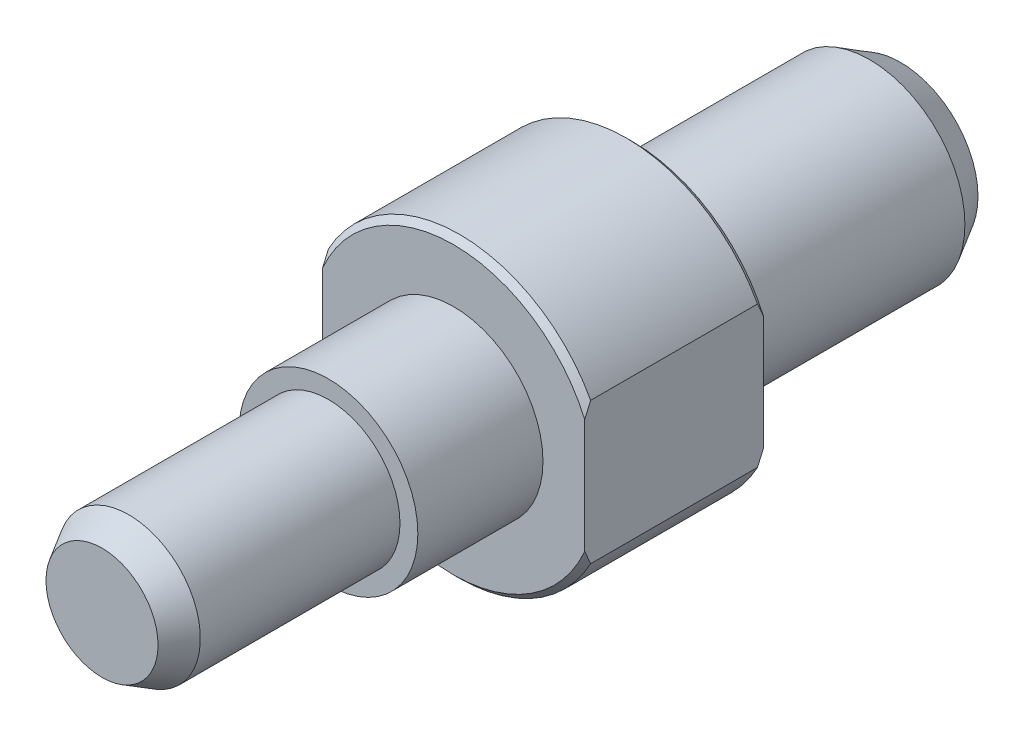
ISO-10303-21;
HEADER;
FILE_DESCRIPTION(('STEP AP214'),'2;1');
FILE_NAME('part.step','',(''),(''),'','','');
FILE_SCHEMA(('AUTOMOTIVE_DESIGN { 1 0 10303 214 1 1 1 1 }'));
ENDSEC;
DATA;
#1=APPLICATION_CONTEXT('core data for automotive mechanical design processes');
#2=APPLICATION_PROTOCOL_DEFINITION('international standard','automotive_design',2000,#1);
#3=PRODUCT_CONTEXT('',#1,'mechanical');
#4=PRODUCT('Part','Part','',(#3));
#5=PRODUCT_RELATED_PRODUCT_CATEGORY('part','',(#4));
#6=PRODUCT_DEFINITION_FORMATION('','',#4);
#7=PRODUCT_DEFINITION_CONTEXT('part definition',#1,'design');
#8=PRODUCT_DEFINITION('design','',#6,#7);
#9=PRODUCT_DEFINITION_SHAPE('','',#8);
#10=(LENGTH_UNIT() NAMED_UNIT(*) SI_UNIT(.MILLI.,.METRE.));
#11=(NAMED_UNIT(*) PLANE_ANGLE_UNIT() SI_UNIT($,.RADIAN.));
#12=(NAMED_UNIT(*) SI_UNIT($,.STERADIAN.) SOLID_ANGLE_UNIT());
#13=UNCERTAINTY_MEASURE_WITH_UNIT(LENGTH_MEASURE(1.E-05),#10,'distance_accuracy_value','');
#14=(GEOMETRIC_REPRESENTATION_CONTEXT(3) GLOBAL_UNCERTAINTY_ASSIGNED_CONTEXT((#13)) GLOBAL_UNIT_ASSIGNED_CONTEXT((#10,
#11,#12)) REPRESENTATION_CONTEXT('',''));
#15=CARTESIAN_POINT('',(0.,0.,0.));
#16=DIRECTION('',(0.,0.,1.));
#17=DIRECTION('',(1.,0.,0.));
#18=AXIS2_PLACEMENT_3D('',#15,#16,#17);
#19=CARTESIAN_POINT('',(0.,0.,44.5));
#20=DIRECTION('',(0.,0.,-1.));
#21=DIRECTION('',(-1.,0.,0.));
#22=AXIS2_PLACEMENT_3D('',#19,#20,#21);
#23=CYLINDRICAL_SURFACE('',#22,6.);
#24=CARTESIAN_POINT('',(0.,0.,25.5));
#25=DIRECTION('',(0.,0.,1.));
#26=DIRECTION('',(1.,0.,0.));
#27=AXIS2_PLACEMENT_3D('',#24,#25,#26);
#28=CIRCLE('',#27,6.);
#29=CARTESIAN_POINT('',(6.,0.,25.5));
#30=VERTEX_POINT('',#29);
#31=EDGE_CURVE('E131',#30,#30,#28,.T.);
#32=ORIENTED_EDGE('',*,*,#31,.T.);
#33=EDGE_LOOP('',(#32));
#34=FACE_BOUND('',#33,.T.);
#35=CARTESIAN_POINT('',(0.,0.,42.2483339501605));
#36=DIRECTION('',(0.,0.,-1.));
#37=DIRECTION('',(-1.,0.,0.));
#38=AXIS2_PLACEMENT_3D('',#35,#36,#37);
#39=CIRCLE('',#38,6.);
#40=CARTESIAN_POINT('',(-6.,0.,42.2483339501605));
#41=VERTEX_POINT('',#40);
#42=EDGE_CURVE('E279',#41,#41,#39,.F.);
#43=ORIENTED_EDGE('',*,*,#42,.F.);
#44=EDGE_LOOP('',(#43));
#45=FACE_BOUND('',#44,.T.);
#46=ADVANCED_FACE('F14',(#34,#45),#23,.T.);
#47=CARTESIAN_POINT('',(0.,0.,0.));
#48=DIRECTION('',(0.,0.,-1.));
#49=DIRECTION('',(-1.,0.,0.));
#50=AXIS2_PLACEMENT_3D('',#47,#48,#49);
#51=CYLINDRICAL_SURFACE('',#50,8.);
#52=CARTESIAN_POINT('',(0.,0.,0.));
#53=DIRECTION('',(0.,0.,1.));
#54=DIRECTION('',(1.,0.,0.));
#55=AXIS2_PLACEMENT_3D('',#52,#53,#54);
#56=CIRCLE('',#55,8.);
#57=CARTESIAN_POINT('',(8.,0.,0.));
#58=VERTEX_POINT('',#57);
#59=EDGE_CURVE('E137',#58,#58,#56,.T.);
#60=ORIENTED_EDGE('',*,*,#59,.F.);
#61=EDGE_LOOP('',(#60));
#62=FACE_BOUND('',#61,.T.);
#63=CARTESIAN_POINT('',(0.,0.,-19.9019237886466));
#64=DIRECTION('',(0.,0.,1.));
#65=DIRECTION('',(1.,0.,0.));
#66=AXIS2_PLACEMENT_3D('',#63,#64,#65);
#67=CIRCLE('',#66,8.);
#68=CARTESIAN_POINT('',(8.,0.,-19.9019237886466));
#69=VERTEX_POINT('',#68);
#70=EDGE_CURVE('E108',#69,#69,#67,.F.);
#71=ORIENTED_EDGE('',*,*,#70,.F.);
#72=EDGE_LOOP('',(#71));
#73=FACE_BOUND('',#72,.T.);
#74=ADVANCED_FACE('F239',(#62,#73),#51,.T.);
#75=CARTESIAN_POINT('',(0.,0.,0.));
#76=DIRECTION('',(0.,0.,1.));
#77=DIRECTION('',(1.,0.,0.));
#78=AXIS2_PLACEMENT_3D('',#75,#76,#77);
#79=PLANE('',#78);
#80=ORIENTED_EDGE('',*,*,#59,.T.);
#81=EDGE_LOOP('',(#80));
#82=FACE_BOUND('',#81,.T.);
#83=DIRECTION('',(0.,-1.,0.));
#84=VECTOR('',#83,1.);
#85=CARTESIAN_POINT('',(11.,0.,0.));
#86=LINE('',#85,#84);
#87=CARTESIAN_POINT('',(11.,4.79583152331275,0.));
#88=VERTEX_POINT('',#87);
#89=CARTESIAN_POINT('',(11.,-4.79583152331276,0.));
#90=VERTEX_POINT('',#89);
#91=EDGE_CURVE('E128',#88,#90,#86,.T.);
#92=ORIENTED_EDGE('',*,*,#91,.T.);
#93=CARTESIAN_POINT('',(0.,0.,0.));
#94=DIRECTION('',(0.,0.,1.));
#95=DIRECTION('',(1.,0.,0.));
#96=AXIS2_PLACEMENT_3D('',#93,#94,#95);
#97=CIRCLE('',#96,12.);
#98=CARTESIAN_POINT('',(-11.,-4.79583152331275,0.));
#99=VERTEX_POINT('',#98);
#100=EDGE_CURVE('E9',#90,#99,#97,.F.);
#101=ORIENTED_EDGE('',*,*,#100,.T.);
#102=DIRECTION('',(0.,-1.,0.));
#103=VECTOR('',#102,1.);
#104=CARTESIAN_POINT('',(-11.,0.,0.));
#105=LINE('',#104,#103);
#106=CARTESIAN_POINT('',(-11.,4.79583152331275,0.));
#107=VERTEX_POINT('',#106);
#108=EDGE_CURVE('E118',#107,#99,#105,.T.);
#109=ORIENTED_EDGE('',*,*,#108,.F.);
#110=CARTESIAN_POINT('',(0.,0.,0.));
#111=DIRECTION('',(0.,0.,1.));
#112=DIRECTION('',(1.,0.,0.));
#113=AXIS2_PLACEMENT_3D('',#110,#111,#112);
#114=CIRCLE('',#113,12.);
#115=EDGE_CURVE('E23',#107,#88,#114,.F.);
#116=ORIENTED_EDGE('',*,*,#115,.T.);
#117=EDGE_LOOP('',(#92,#101,#109,#116));
#118=FACE_BOUND('',#117,.T.);
#119=ADVANCED_FACE('F229',(#82,#118),#79,.F.);
#120=CARTESIAN_POINT('',(0.,0.,15.));
#121=DIRECTION('',(0.,0.,-1.));
#122=DIRECTION('',(-1.,0.,0.));
#123=AXIS2_PLACEMENT_3D('',#120,#121,#122);
#124=CYLINDRICAL_SURFACE('',#123,12.5);
#125=DIRECTION('',(0.,0.,1.));
#126=VECTOR('',#125,1.);
#127=CARTESIAN_POINT('',(-11.,5.93717104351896,-22.5));
#128=LINE('',#127,#126);
#129=CARTESIAN_POINT('',(-11.,5.93717104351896,0.49999999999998));
#130=VERTEX_POINT('',#129);
#131=CARTESIAN_POINT('',(-11.,5.93717104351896,14.5));
#132=VERTEX_POINT('',#131);
#133=EDGE_CURVE('E110',#130,#132,#128,.T.);
#134=ORIENTED_EDGE('',*,*,#133,.T.);
#135=CARTESIAN_POINT('',(0.,0.,14.5));
#136=DIRECTION('',(0.,0.,1.));
#137=DIRECTION('',(1.,0.,0.));
#138=AXIS2_PLACEMENT_3D('',#135,#136,#137);
#139=CIRCLE('',#138,12.5);
#140=CARTESIAN_POINT('',(11.,5.93717104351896,14.5));
#141=VERTEX_POINT('',#140);
#142=EDGE_CURVE('E84',#132,#141,#139,.F.);
#143=ORIENTED_EDGE('',*,*,#142,.T.);
#144=DIRECTION('',(0.,0.,1.));
#145=VECTOR('',#144,1.);
#146=CARTESIAN_POINT('',(11.,5.93717104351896,-22.5));
#147=LINE('',#146,#145);
#148=CARTESIAN_POINT('',(11.,5.93717104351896,0.49999999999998));
#149=VERTEX_POINT('',#148);
#150=EDGE_CURVE('E122',#149,#141,#147,.T.);
#151=ORIENTED_EDGE('',*,*,#150,.F.);
#152=CARTESIAN_POINT('',(0.,0.,0.49999999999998));
#153=DIRECTION('',(0.,0.,1.));
#154=DIRECTION('',(1.,0.,0.));
#155=AXIS2_PLACEMENT_3D('',#152,#153,#154);
#156=CIRCLE('',#155,12.5);
#157=EDGE_CURVE('E89',#149,#130,#156,.T.);
#158=ORIENTED_EDGE('',*,*,#157,.T.);
#159=EDGE_LOOP('',(#134,#143,#151,#158));
#160=FACE_BOUND('',#159,.T.);
#161=ADVANCED_FACE('F222',(#160),#124,.T.);
#162=DIRECTION('',(0.,0.,1.));
#163=VECTOR('',#162,1.);
#164=CARTESIAN_POINT('',(11.,-5.93717104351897,-22.5));
#165=LINE('',#164,#163);
#166=CARTESIAN_POINT('',(11.,-5.93717104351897,0.499999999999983));
#167=VERTEX_POINT('',#166);
#168=CARTESIAN_POINT('',(11.,-5.93717104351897,14.5));
#169=VERTEX_POINT('',#168);
#170=EDGE_CURVE('E125',#167,#169,#165,.T.);
#171=ORIENTED_EDGE('',*,*,#170,.T.);
#172=CARTESIAN_POINT('',(0.,0.,14.5));
#173=DIRECTION('',(0.,0.,1.));
#174=DIRECTION('',(1.,0.,0.));
#175=AXIS2_PLACEMENT_3D('',#172,#173,#174);
#176=CIRCLE('',#175,12.5);
#177=CARTESIAN_POINT('',(-11.,-5.93717104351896,14.5));
#178=VERTEX_POINT('',#177);
#179=EDGE_CURVE('E209',#169,#178,#176,.F.);
#180=ORIENTED_EDGE('',*,*,#179,.T.);
#181=DIRECTION('',(0.,0.,1.));
#182=VECTOR('',#181,1.);
#183=CARTESIAN_POINT('',(-11.,-5.93717104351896,-22.5));
#184=LINE('',#183,#182);
#185=CARTESIAN_POINT('',(-11.,-5.93717104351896,0.49999999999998));
#186=VERTEX_POINT('',#185);
#187=EDGE_CURVE('E107',#186,#178,#184,.T.);
#188=ORIENTED_EDGE('',*,*,#187,.F.);
#189=CARTESIAN_POINT('',(0.,0.,0.49999999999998));
#190=DIRECTION('',(0.,0.,1.));
#191=DIRECTION('',(1.,0.,0.));
#192=AXIS2_PLACEMENT_3D('',#189,#190,#191);
#193=CIRCLE('',#192,12.5);
#194=EDGE_CURVE('E206',#186,#167,#193,.T.);
#195=ORIENTED_EDGE('',*,*,#194,.T.);
#196=EDGE_LOOP('',(#171,#180,#188,#195));
#197=FACE_BOUND('',#196,.T.);
#198=ADVANCED_FACE('F213',(#197),#124,.T.);
#199=CARTESIAN_POINT('',(0.,0.,15.));
#200=DIRECTION('',(0.,0.,1.));
#201=DIRECTION('',(1.,0.,0.));
#202=AXIS2_PLACEMENT_3D('',#199,#200,#201);
#203=PLANE('',#202);
#204=CARTESIAN_POINT('',(0.,0.,15.));
#205=DIRECTION('',(0.,0.,1.));
#206=DIRECTION('',(1.,0.,0.));
#207=AXIS2_PLACEMENT_3D('',#204,#205,#206);
#208=CIRCLE('',#207,7.5);
#209=CARTESIAN_POINT('',(7.5,0.,15.));
#210=VERTEX_POINT('',#209);
#211=EDGE_CURVE('E134',#210,#210,#208,.T.);
#212=ORIENTED_EDGE('',*,*,#211,.F.);
#213=EDGE_LOOP('',(#212));
#214=FACE_BOUND('',#213,.T.);
#215=DIRECTION('',(0.,-1.,0.));
#216=VECTOR('',#215,1.);
#217=CARTESIAN_POINT('',(11.,5.93717104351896,15.));
#218=LINE('',#217,#216);
#219=CARTESIAN_POINT('',(11.,4.79583152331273,15.));
#220=VERTEX_POINT('',#219);
#221=CARTESIAN_POINT('',(11.,-4.79583152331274,15.));
#222=VERTEX_POINT('',#221);
#223=EDGE_CURVE('E100',#220,#222,#218,.T.);
#224=ORIENTED_EDGE('',*,*,#223,.F.);
#225=CARTESIAN_POINT('',(0.,0.,15.));
#226=DIRECTION('',(0.,0.,1.));
#227=DIRECTION('',(1.,0.,0.));
#228=AXIS2_PLACEMENT_3D('',#225,#226,#227);
#229=CIRCLE('',#228,12.);
#230=CARTESIAN_POINT('',(-11.,4.79583152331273,15.));
#231=VERTEX_POINT('',#230);
#232=EDGE_CURVE('E83',#220,#231,#229,.T.);
#233=ORIENTED_EDGE('',*,*,#232,.T.);
#234=DIRECTION('',(0.,-1.,0.));
#235=VECTOR('',#234,1.);
#236=CARTESIAN_POINT('',(-11.,5.93717104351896,15.));
#237=LINE('',#236,#235);
#238=CARTESIAN_POINT('',(-11.,-4.79583152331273,15.));
#239=VERTEX_POINT('',#238);
#240=EDGE_CURVE('E97',#231,#239,#237,.T.);
#241=ORIENTED_EDGE('',*,*,#240,.T.);
#242=CARTESIAN_POINT('',(0.,0.,15.));
#243=DIRECTION('',(0.,0.,1.));
#244=DIRECTION('',(1.,0.,0.));
#245=AXIS2_PLACEMENT_3D('',#242,#243,#244);
#246=CIRCLE('',#245,12.);
#247=EDGE_CURVE('E102',#239,#222,#246,.T.);
#248=ORIENTED_EDGE('',*,*,#247,.T.);
#249=EDGE_LOOP('',(#224,#233,#241,#248));
#250=FACE_BOUND('',#249,.T.);
#251=ADVANCED_FACE('F95',(#214,#250),#203,.T.);
#252=CARTESIAN_POINT('',(0.,0.,25.5));
#253=DIRECTION('',(0.,0.,-1.));
#254=DIRECTION('',(-1.,0.,0.));
#255=AXIS2_PLACEMENT_3D('',#252,#253,#254);
#256=CYLINDRICAL_SURFACE('',#255,7.5);
#257=CARTESIAN_POINT('',(0.,0.,25.5));
#258=DIRECTION('',(0.,0.,1.));
#259=DIRECTION('',(1.,0.,0.));
#260=AXIS2_PLACEMENT_3D('',#257,#258,#259);
#261=CIRCLE('',#260,7.5);
#262=CARTESIAN_POINT('',(7.5,0.,25.5));
#263=VERTEX_POINT('',#262);
#264=EDGE_CURVE('E130',#263,#263,#261,.T.);
#265=ORIENTED_EDGE('',*,*,#264,.F.);
#266=EDGE_LOOP('',(#265));
#267=FACE_BOUND('',#266,.T.);
#268=ORIENTED_EDGE('',*,*,#211,.T.);
#269=EDGE_LOOP('',(#268));
#270=FACE_BOUND('',#269,.T.);
#271=ADVANCED_FACE('F253',(#267,#270),#256,.T.);
#272=CARTESIAN_POINT('',(0.,0.,25.5));
#273=DIRECTION('',(0.,0.,1.));
#274=DIRECTION('',(1.,0.,0.));
#275=AXIS2_PLACEMENT_3D('',#272,#273,#274);
#276=PLANE('',#275);
#277=ORIENTED_EDGE('',*,*,#31,.F.);
#278=EDGE_LOOP('',(#277));
#279=FACE_BOUND('',#278,.T.);
#280=ORIENTED_EDGE('',*,*,#264,.T.);
#281=EDGE_LOOP('',(#280));
#282=FACE_BOUND('',#281,.T.);
#283=ADVANCED_FACE('F250',(#279,#282),#276,.T.);
#284=CARTESIAN_POINT('',(11.,5.93717104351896,-22.5));
#285=DIRECTION('',(-1.,0.,0.));
#286=DIRECTION('',(0.,-1.,0.));
#287=AXIS2_PLACEMENT_3D('',#284,#285,#286);
#288=PLANE('',#287);
#289=ORIENTED_EDGE('',*,*,#150,.T.);
#290=CARTESIAN_POINT('',(11.,5.93717104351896,14.5));
#291=CARTESIAN_POINT('',(11.,5.84334950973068,14.5445621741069));
#292=CARTESIAN_POINT('',(11.,5.74921029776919,14.5884584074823));
#293=CARTESIAN_POINT('',(11.,5.56030813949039,14.6748237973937));
#294=CARTESIAN_POINT('',(11.,5.46554535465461,14.7172933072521));
#295=CARTESIAN_POINT('',(11.,5.27535928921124,14.8007330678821));
#296=CARTESIAN_POINT('',(11.,5.1799359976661,14.8417032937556));
#297=CARTESIAN_POINT('',(11.,4.98839837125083,14.9220630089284));
#298=CARTESIAN_POINT('',(11.,4.89228386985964,14.9614521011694));
#299=CARTESIAN_POINT('',(11.,4.79583152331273,15.));
#300=B_SPLINE_CURVE_WITH_KNOTS('',3,(#290,#291,#292,#293,#294,#295,#296,#297,#298,#299),
.UNSPECIFIED.,.F.,.F.,(4,2,2,2,4),(0.,0.311598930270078,0.623120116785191,0.934646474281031,
1.24625057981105),.UNSPECIFIED.);
#301=EDGE_CURVE('E195',#141,#220,#300,.T.);
#302=ORIENTED_EDGE('',*,*,#301,.T.);
#303=ORIENTED_EDGE('',*,*,#223,.T.);
#304=CARTESIAN_POINT('',(11.,-4.79583152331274,15.));
#305=CARTESIAN_POINT('',(11.,-4.89228386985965,14.9614521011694));
#306=CARTESIAN_POINT('',(11.,-4.98839837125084,14.9220630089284));
#307=CARTESIAN_POINT('',(11.,-5.17993599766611,14.8417032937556));
#308=CARTESIAN_POINT('',(11.,-5.27535928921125,14.8007330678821));
#309=CARTESIAN_POINT('',(11.,-5.46554535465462,14.7172933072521));
#310=CARTESIAN_POINT('',(11.,-5.5603081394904,14.6748237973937));
#311=CARTESIAN_POINT('',(11.,-5.7492102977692,14.5884584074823));
#312=CARTESIAN_POINT('',(11.,-5.84334950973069,14.5445621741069));
#313=CARTESIAN_POINT('',(11.,-5.93717104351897,14.5));
#314=B_SPLINE_CURVE_WITH_KNOTS('',3,(#304,#305,#306,#307,#308,#309,#310,#311,#312,#313),
.UNSPECIFIED.,.F.,.F.,(4,2,2,2,4),(0.,0.311604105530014,0.623130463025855,0.934651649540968,
1.24625057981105),.UNSPECIFIED.);
#315=EDGE_CURVE('E188',#222,#169,#314,.T.);
#316=ORIENTED_EDGE('',*,*,#315,.T.);
#317=ORIENTED_EDGE('',*,*,#170,.F.);
#318=CARTESIAN_POINT('',(11.,-5.93717104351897,0.49999999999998));
#319=CARTESIAN_POINT('',(11.,-5.8433495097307,0.455437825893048));
#320=CARTESIAN_POINT('',(11.,-5.7492102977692,0.411541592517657));
#321=CARTESIAN_POINT('',(11.,-5.56030813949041,0.32517620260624));
#322=CARTESIAN_POINT('',(11.,-5.46554535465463,0.282706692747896));
#323=CARTESIAN_POINT('',(11.,-5.27535928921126,0.199266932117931));
#324=CARTESIAN_POINT('',(11.,-5.17993599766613,0.158296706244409));
#325=CARTESIAN_POINT('',(11.,-4.98839837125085,0.0779369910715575));
#326=CARTESIAN_POINT('',(11.,-4.89228386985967,0.0385478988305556));
#327=CARTESIAN_POINT('',(11.,-4.79583152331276,0.));
#328=B_SPLINE_CURVE_WITH_KNOTS('',3,(#318,#319,#320,#321,#322,#323,#324,#325,#326,#327),
.UNSPECIFIED.,.F.,.F.,(4,2,2,2,4),(0.,0.311598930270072,0.623120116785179,0.934646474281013,
1.24625057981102),.UNSPECIFIED.);
#329=EDGE_CURVE('E30',#167,#90,#328,.T.);
#330=ORIENTED_EDGE('',*,*,#329,.T.);
#331=ORIENTED_EDGE('',*,*,#91,.F.);
#332=CARTESIAN_POINT('',(11.,4.79583152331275,0.));
#333=CARTESIAN_POINT('',(11.,4.89228386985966,0.0385478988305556));
#334=CARTESIAN_POINT('',(11.,4.98839837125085,0.0779369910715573));
#335=CARTESIAN_POINT('',(11.,5.17993599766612,0.158296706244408));
#336=CARTESIAN_POINT('',(11.,5.27535928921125,0.19926693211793));
#337=CARTESIAN_POINT('',(11.,5.46554535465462,0.282706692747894));
#338=CARTESIAN_POINT('',(11.,5.5603081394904,0.325176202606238));
#339=CARTESIAN_POINT('',(11.,5.7492102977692,0.411541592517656));
#340=CARTESIAN_POINT('',(11.,5.84334950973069,0.455437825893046));
#341=CARTESIAN_POINT('',(11.,5.93717104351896,0.49999999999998));
#342=B_SPLINE_CURVE_WITH_KNOTS('',3,(#332,#333,#334,#335,#336,#337,#338,#339,#340,#341),
.UNSPECIFIED.,.F.,.F.,(4,2,2,2,4),(0.,0.311604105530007,0.623130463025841,0.934651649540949,
1.24625057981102),.UNSPECIFIED.);
#343=EDGE_CURVE('E218',#88,#149,#342,.T.);
#344=ORIENTED_EDGE('',*,*,#343,.T.);
#345=EDGE_LOOP('',(#289,#302,#303,#316,#317,#330,#331,#344));
#346=FACE_BOUND('',#345,.T.);
#347=ADVANCED_FACE('F160',(#346),#288,.F.);
#348=CARTESIAN_POINT('',(-11.,5.93717104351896,-22.5));
#349=DIRECTION('',(-1.,0.,0.));
#350=DIRECTION('',(0.,0.,1.));
#351=AXIS2_PLACEMENT_3D('',#348,#349,#350);
#352=PLANE('',#351);
#353=ORIENTED_EDGE('',*,*,#240,.F.);
#354=CARTESIAN_POINT('',(-11.,4.79583152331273,15.));
#355=CARTESIAN_POINT('',(-11.,4.89228386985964,14.9614521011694));
#356=CARTESIAN_POINT('',(-11.,4.98839837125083,14.9220630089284));
#357=CARTESIAN_POINT('',(-11.,5.1799359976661,14.8417032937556));
#358=CARTESIAN_POINT('',(-11.,5.27535928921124,14.8007330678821));
#359=CARTESIAN_POINT('',(-11.,5.46554535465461,14.7172933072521));
#360=CARTESIAN_POINT('',(-11.,5.56030813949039,14.6748237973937));
#361=CARTESIAN_POINT('',(-11.,5.74921029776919,14.5884584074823));
#362=CARTESIAN_POINT('',(-11.,5.84334950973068,14.5445621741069));
#363=CARTESIAN_POINT('',(-11.,5.93717104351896,14.5));
#364=B_SPLINE_CURVE_WITH_KNOTS('',3,(#354,#355,#356,#357,#358,#359,#360,#361,#362,#363),
.UNSPECIFIED.,.F.,.F.,(4,2,2,2,4),(0.,0.311604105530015,0.623130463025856,0.934651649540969,
1.24625057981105),.UNSPECIFIED.);
#365=EDGE_CURVE('E79',#231,#132,#364,.T.);
#366=ORIENTED_EDGE('',*,*,#365,.T.);
#367=ORIENTED_EDGE('',*,*,#133,.F.);
#368=CARTESIAN_POINT('',(-11.,5.93717104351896,0.49999999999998));
#369=CARTESIAN_POINT('',(-11.,5.84334950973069,0.455437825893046));
#370=CARTESIAN_POINT('',(-11.,5.7492102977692,0.411541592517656));
#371=CARTESIAN_POINT('',(-11.,5.5603081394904,0.325176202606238));
#372=CARTESIAN_POINT('',(-11.,5.46554535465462,0.282706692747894));
#373=CARTESIAN_POINT('',(-11.,5.27535928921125,0.19926693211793));
#374=CARTESIAN_POINT('',(-11.,5.17993599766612,0.158296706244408));
#375=CARTESIAN_POINT('',(-11.,4.98839837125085,0.0779369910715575));
#376=CARTESIAN_POINT('',(-11.,4.89228386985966,0.0385478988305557));
#377=CARTESIAN_POINT('',(-11.,4.79583152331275,0.));
#378=B_SPLINE_CURVE_WITH_KNOTS('',3,(#368,#369,#370,#371,#372,#373,#374,#375,#376,#377),
.UNSPECIFIED.,.F.,.F.,(4,2,2,2,4),(0.,0.311598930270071,0.623120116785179,0.934646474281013,
1.24625057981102),.UNSPECIFIED.);
#379=EDGE_CURVE('E101',#130,#107,#378,.T.);
#380=ORIENTED_EDGE('',*,*,#379,.T.);
#381=ORIENTED_EDGE('',*,*,#108,.T.);
#382=CARTESIAN_POINT('',(-11.,-4.79583152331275,0.));
#383=CARTESIAN_POINT('',(-11.,-4.89228386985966,0.0385478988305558));
#384=CARTESIAN_POINT('',(-11.,-4.98839837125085,0.0779369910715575));
#385=CARTESIAN_POINT('',(-11.,-5.17993599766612,0.158296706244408));
#386=CARTESIAN_POINT('',(-11.,-5.27535928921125,0.19926693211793));
#387=CARTESIAN_POINT('',(-11.,-5.46554535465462,0.282706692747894));
#388=CARTESIAN_POINT('',(-11.,-5.5603081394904,0.325176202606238));
#389=CARTESIAN_POINT('',(-11.,-5.7492102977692,0.411541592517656));
#390=CARTESIAN_POINT('',(-11.,-5.84334950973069,0.455437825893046));
#391=CARTESIAN_POINT('',(-11.,-5.93717104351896,0.49999999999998));
#392=B_SPLINE_CURVE_WITH_KNOTS('',3,(#382,#383,#384,#385,#386,#387,#388,#389,#390,#391),
.UNSPECIFIED.,.F.,.F.,(4,2,2,2,4),(0.,0.311604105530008,0.623130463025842,0.934651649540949,
1.24625057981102),.UNSPECIFIED.);
#393=EDGE_CURVE('E149',#99,#186,#392,.T.);
#394=ORIENTED_EDGE('',*,*,#393,.T.);
#395=ORIENTED_EDGE('',*,*,#187,.T.);
#396=CARTESIAN_POINT('',(-11.,-5.93717104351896,14.5));
#397=CARTESIAN_POINT('',(-11.,-5.84334950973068,14.5445621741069));
#398=CARTESIAN_POINT('',(-11.,-5.74921029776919,14.5884584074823));
#399=CARTESIAN_POINT('',(-11.,-5.56030813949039,14.6748237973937));
#400=CARTESIAN_POINT('',(-11.,-5.46554535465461,14.7172933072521));
#401=CARTESIAN_POINT('',(-11.,-5.27535928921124,14.8007330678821));
#402=CARTESIAN_POINT('',(-11.,-5.1799359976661,14.8417032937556));
#403=CARTESIAN_POINT('',(-11.,-4.98839837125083,14.9220630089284));
#404=CARTESIAN_POINT('',(-11.,-4.89228386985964,14.9614521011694));
#405=CARTESIAN_POINT('',(-11.,-4.79583152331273,15.));
#406=B_SPLINE_CURVE_WITH_KNOTS('',3,(#396,#397,#398,#399,#400,#401,#402,#403,#404,#405),
.UNSPECIFIED.,.F.,.F.,(4,2,2,2,4),(0.,0.311598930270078,0.623120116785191,0.934646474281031,
1.24625057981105),.UNSPECIFIED.);
#407=EDGE_CURVE('E90',#178,#239,#406,.T.);
#408=ORIENTED_EDGE('',*,*,#407,.T.);
#409=EDGE_LOOP('',(#353,#366,#367,#380,#381,#394,#395,#408));
#410=FACE_BOUND('',#409,.T.);
#411=ADVANCED_FACE('F104',(#410),#352,.T.);
#412=CARTESIAN_POINT('',(0.,0.,-13.5483748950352));
#413=DIRECTION('',(0.,0.,1.));
#414=DIRECTION('',(1.,0.,0.));
#415=AXIS2_PLACEMENT_3D('',#412,#413,#414);
#416=CONICAL_SURFACE('',#415,11.668223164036,0.523598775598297);
#417=CARTESIAN_POINT('',(0.,0.,-22.5));
#418=DIRECTION('',(0.,0.,1.));
#419=DIRECTION('',(1.,0.,0.));
#420=AXIS2_PLACEMENT_3D('',#417,#418,#419);
#421=CIRCLE('',#420,6.5);
#422=CARTESIAN_POINT('',(6.5,0.,-22.5));
#423=VERTEX_POINT('',#422);
#424=EDGE_CURVE('E113',#423,#423,#421,.T.);
#425=ORIENTED_EDGE('',*,*,#424,.T.);
#426=EDGE_LOOP('',(#425));
#427=FACE_BOUND('',#426,.T.);
#428=ORIENTED_EDGE('',*,*,#70,.T.);
#429=EDGE_LOOP('',(#428));
#430=FACE_BOUND('',#429,.T.);
#431=ADVANCED_FACE('F159',(#427,#430),#416,.T.);
#432=CARTESIAN_POINT('',(0.,0.,-22.5));
#433=DIRECTION('',(0.,0.,1.));
#434=DIRECTION('',(1.,0.,0.));
#435=AXIS2_PLACEMENT_3D('',#432,#433,#434);
#436=PLANE('',#435);
#437=ORIENTED_EDGE('',*,*,#424,.F.);
#438=EDGE_LOOP('',(#437));
#439=FACE_BOUND('',#438,.T.);
#440=ADVANCED_FACE('F266',(#439),#436,.F.);
#441=CARTESIAN_POINT('',(0.,0.,44.5));
#442=DIRECTION('',(0.,0.,-1.));
#443=DIRECTION('',(-1.,0.,0.));
#444=AXIS2_PLACEMENT_3D('',#441,#442,#443);
#445=CONICAL_SURFACE('',#444,4.7,0.523598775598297);
#446=CARTESIAN_POINT('',(0.,0.,44.5));
#447=DIRECTION('',(0.,0.,1.));
#448=DIRECTION('',(1.,0.,0.));
#449=AXIS2_PLACEMENT_3D('',#446,#447,#448);
#450=CIRCLE('',#449,4.7);
#451=CARTESIAN_POINT('',(4.7,0.,44.5));
#452=VERTEX_POINT('',#451);
#453=EDGE_CURVE('E281',#452,#452,#450,.T.);
#454=ORIENTED_EDGE('',*,*,#453,.F.);
#455=EDGE_LOOP('',(#454));
#456=FACE_BOUND('',#455,.T.);
#457=ORIENTED_EDGE('',*,*,#42,.T.);
#458=EDGE_LOOP('',(#457));
#459=FACE_BOUND('',#458,.T.);
#460=ADVANCED_FACE('F268',(#456,#459),#445,.T.);
#461=CARTESIAN_POINT('',(0.,0.,44.5));
#462=DIRECTION('',(0.,0.,1.));
#463=DIRECTION('',(1.,0.,0.));
#464=AXIS2_PLACEMENT_3D('',#461,#462,#463);
#465=PLANE('',#464);
#466=ORIENTED_EDGE('',*,*,#453,.T.);
#467=EDGE_LOOP('',(#466));
#468=FACE_BOUND('',#467,.T.);
#469=ADVANCED_FACE('F249',(#468),#465,.T.);
#470=CARTESIAN_POINT('',(0.,0.,15.));
#471=DIRECTION('',(0.,0.,-1.));
#472=DIRECTION('',(-1.,0.,0.));
#473=AXIS2_PLACEMENT_3D('',#470,#471,#472);
#474=CONICAL_SURFACE('',#473,12.,0.785398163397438);
#475=ORIENTED_EDGE('',*,*,#301,.F.);
#476=ORIENTED_EDGE('',*,*,#142,.F.);
#477=ORIENTED_EDGE('',*,*,#365,.F.);
#478=ORIENTED_EDGE('',*,*,#232,.F.);
#479=EDGE_LOOP('',(#475,#476,#477,#478));
#480=FACE_BOUND('',#479,.T.);
#481=ADVANCED_FACE('F82',(#480),#474,.T.);
#482=CARTESIAN_POINT('',(0.,0.,15.));
#483=DIRECTION('',(0.,0.,-1.));
#484=DIRECTION('',(-1.,0.,0.));
#485=AXIS2_PLACEMENT_3D('',#482,#483,#484);
#486=CONICAL_SURFACE('',#485,12.,0.785398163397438);
#487=ORIENTED_EDGE('',*,*,#407,.F.);
#488=ORIENTED_EDGE('',*,*,#179,.F.);
#489=ORIENTED_EDGE('',*,*,#315,.F.);
#490=ORIENTED_EDGE('',*,*,#247,.F.);
#491=EDGE_LOOP('',(#487,#488,#489,#490));
#492=FACE_BOUND('',#491,.T.);
#493=ADVANCED_FACE('F178',(#492),#486,.T.);
#494=CARTESIAN_POINT('',(0.,0.,0.49999999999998));
#495=DIRECTION('',(0.,0.,1.));
#496=DIRECTION('',(1.,0.,0.));
#497=AXIS2_PLACEMENT_3D('',#494,#495,#496);
#498=CONICAL_SURFACE('',#497,12.5,0.785398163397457);
#499=ORIENTED_EDGE('',*,*,#393,.F.);
#500=ORIENTED_EDGE('',*,*,#100,.F.);
#501=ORIENTED_EDGE('',*,*,#329,.F.);
#502=ORIENTED_EDGE('',*,*,#194,.F.);
#503=EDGE_LOOP('',(#499,#500,#501,#502));
#504=FACE_BOUND('',#503,.T.);
#505=ADVANCED_FACE('F181',(#504),#498,.T.);
#506=CARTESIAN_POINT('',(0.,0.,0.49999999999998));
#507=DIRECTION('',(0.,0.,1.));
#508=DIRECTION('',(1.,0.,0.));
#509=AXIS2_PLACEMENT_3D('',#506,#507,#508);
#510=CONICAL_SURFACE('',#509,12.5,0.785398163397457);
#511=ORIENTED_EDGE('',*,*,#343,.F.);
#512=ORIENTED_EDGE('',*,*,#115,.F.);
#513=ORIENTED_EDGE('',*,*,#379,.F.);
#514=ORIENTED_EDGE('',*,*,#157,.F.);
#515=EDGE_LOOP('',(#511,#512,#513,#514));
#516=FACE_BOUND('',#515,.T.);
#517=ADVANCED_FACE('F16',(#516),#510,.T.);
#518=CLOSED_SHELL('',(#46,#74,#119,#161,#198,#251,#271,#283,#347,#411,#431,#440,#460,#469,#481,
#493,#505,#517));
#519=MANIFOLD_SOLID_BREP('B1',#518);
#520=ADVANCED_BREP_SHAPE_REPRESENTATION('',(#18,#519),#14);
#521=SHAPE_DEFINITION_REPRESENTATION(#9,#520);
ENDSEC;
END-ISO-10303-21;
